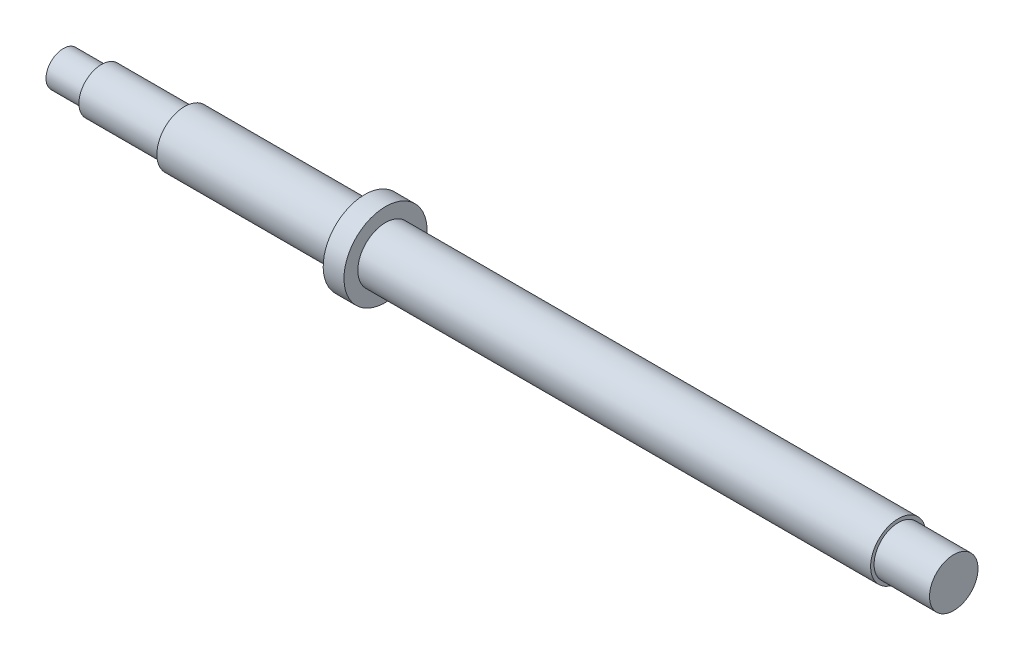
ISO-10303-21;
HEADER;
FILE_DESCRIPTION(('STEP AP214'),'2;1');
FILE_NAME('part.step','',(''),(''),'','','');
FILE_SCHEMA(('AUTOMOTIVE_DESIGN { 1 0 10303 214 1 1 1 1 }'));
ENDSEC;
DATA;
#1=APPLICATION_CONTEXT('core data for automotive mechanical design processes');
#2=APPLICATION_PROTOCOL_DEFINITION('international standard','automotive_design',2000,#1);
#3=PRODUCT_CONTEXT('',#1,'mechanical');
#4=PRODUCT('Part','Part','',(#3));
#5=PRODUCT_RELATED_PRODUCT_CATEGORY('part','',(#4));
#6=PRODUCT_DEFINITION_FORMATION('','',#4);
#7=PRODUCT_DEFINITION_CONTEXT('part definition',#1,'design');
#8=PRODUCT_DEFINITION('design','',#6,#7);
#9=PRODUCT_DEFINITION_SHAPE('','',#8);
#10=(LENGTH_UNIT() NAMED_UNIT(*) SI_UNIT(.MILLI.,.METRE.));
#11=(NAMED_UNIT(*) PLANE_ANGLE_UNIT() SI_UNIT($,.RADIAN.));
#12=(NAMED_UNIT(*) SI_UNIT($,.STERADIAN.) SOLID_ANGLE_UNIT());
#13=UNCERTAINTY_MEASURE_WITH_UNIT(LENGTH_MEASURE(1.E-05),#10,'distance_accuracy_value','');
#14=(GEOMETRIC_REPRESENTATION_CONTEXT(3) GLOBAL_UNCERTAINTY_ASSIGNED_CONTEXT((#13)) GLOBAL_UNIT_ASSIGNED_CONTEXT((#10,
#11,#12)) REPRESENTATION_CONTEXT('',''));
#15=CARTESIAN_POINT('',(0.,0.,0.));
#16=DIRECTION('',(0.,0.,1.));
#17=DIRECTION('',(1.,0.,0.));
#18=AXIS2_PLACEMENT_3D('',#15,#16,#17);
#19=CARTESIAN_POINT('',(0.,0.,0.));
#20=DIRECTION('',(-1.,0.,0.));
#21=DIRECTION('',(0.,-1.,0.));
#22=AXIS2_PLACEMENT_3D('',#19,#20,#21);
#23=PLANE('',#22);
#24=CARTESIAN_POINT('',(0.,0.,0.));
#25=DIRECTION('',(1.,0.,0.));
#26=DIRECTION('',(0.,1.,0.));
#27=AXIS2_PLACEMENT_3D('',#24,#25,#26);
#28=CIRCLE('',#27,5.);
#29=CARTESIAN_POINT('',(0.,5.,0.));
#30=VERTEX_POINT('',#29);
#31=EDGE_CURVE('E10',#30,#30,#28,.T.);
#32=ORIENTED_EDGE('',*,*,#31,.F.);
#33=EDGE_LOOP('',(#32));
#34=FACE_BOUND('',#33,.T.);
#35=ADVANCED_FACE('F34',(#34),#23,.T.);
#36=CARTESIAN_POINT('',(257.,0.,0.));
#37=DIRECTION('',(1.,0.,0.));
#38=DIRECTION('',(0.,1.,0.));
#39=AXIS2_PLACEMENT_3D('',#36,#37,#38);
#40=CYLINDRICAL_SURFACE('',#39,5.);
#41=ORIENTED_EDGE('',*,*,#31,.T.);
#42=EDGE_LOOP('',(#41));
#43=FACE_BOUND('',#42,.T.);
#44=CARTESIAN_POINT('',(11.,0.,0.));
#45=DIRECTION('',(1.,0.,0.));
#46=DIRECTION('',(0.,1.,0.));
#47=AXIS2_PLACEMENT_3D('',#44,#45,#46);
#48=CIRCLE('',#47,5.);
#49=CARTESIAN_POINT('',(11.,5.,0.));
#50=VERTEX_POINT('',#49);
#51=EDGE_CURVE('E40',#50,#50,#48,.T.);
#52=ORIENTED_EDGE('',*,*,#51,.F.);
#53=EDGE_LOOP('',(#52));
#54=FACE_BOUND('',#53,.T.);
#55=ADVANCED_FACE('F94',(#43,#54),#40,.T.);
#56=CARTESIAN_POINT('',(11.,5.,0.));
#57=DIRECTION('',(-1.,0.,0.));
#58=DIRECTION('',(0.,-1.,0.));
#59=AXIS2_PLACEMENT_3D('',#56,#57,#58);
#60=PLANE('',#59);
#61=ORIENTED_EDGE('',*,*,#51,.T.);
#62=EDGE_LOOP('',(#61));
#63=FACE_BOUND('',#62,.T.);
#64=CARTESIAN_POINT('',(11.,0.,0.));
#65=DIRECTION('',(1.,0.,0.));
#66=DIRECTION('',(0.,1.,0.));
#67=AXIS2_PLACEMENT_3D('',#64,#65,#66);
#68=CIRCLE('',#67,6.5);
#69=CARTESIAN_POINT('',(11.,6.5,0.));
#70=VERTEX_POINT('',#69);
#71=EDGE_CURVE('E44',#70,#70,#68,.T.);
#72=ORIENTED_EDGE('',*,*,#71,.F.);
#73=EDGE_LOOP('',(#72));
#74=FACE_BOUND('',#73,.T.);
#75=ADVANCED_FACE('F99',(#63,#74),#60,.T.);
#76=CARTESIAN_POINT('',(257.,0.,0.));
#77=DIRECTION('',(1.,0.,0.));
#78=DIRECTION('',(0.,1.,0.));
#79=AXIS2_PLACEMENT_3D('',#76,#77,#78);
#80=CYLINDRICAL_SURFACE('',#79,6.5);
#81=ORIENTED_EDGE('',*,*,#71,.T.);
#82=EDGE_LOOP('',(#81));
#83=FACE_BOUND('',#82,.T.);
#84=CARTESIAN_POINT('',(35.,0.,0.));
#85=DIRECTION('',(1.,0.,0.));
#86=DIRECTION('',(0.,1.,0.));
#87=AXIS2_PLACEMENT_3D('',#84,#85,#86);
#88=CIRCLE('',#87,6.5);
#89=CARTESIAN_POINT('',(35.,6.5,0.));
#90=VERTEX_POINT('',#89);
#91=EDGE_CURVE('E48',#90,#90,#88,.T.);
#92=ORIENTED_EDGE('',*,*,#91,.F.);
#93=EDGE_LOOP('',(#92));
#94=FACE_BOUND('',#93,.T.);
#95=ADVANCED_FACE('F103',(#83,#94),#80,.T.);
#96=CARTESIAN_POINT('',(35.,6.5,0.));
#97=DIRECTION('',(-1.,0.,0.));
#98=DIRECTION('',(0.,-1.,0.));
#99=AXIS2_PLACEMENT_3D('',#96,#97,#98);
#100=PLANE('',#99);
#101=ORIENTED_EDGE('',*,*,#91,.T.);
#102=EDGE_LOOP('',(#101));
#103=FACE_BOUND('',#102,.T.);
#104=CARTESIAN_POINT('',(35.,0.,0.));
#105=DIRECTION('',(1.,0.,0.));
#106=DIRECTION('',(0.,1.,0.));
#107=AXIS2_PLACEMENT_3D('',#104,#105,#106);
#108=CIRCLE('',#107,8.);
#109=CARTESIAN_POINT('',(35.,8.,0.));
#110=VERTEX_POINT('',#109);
#111=EDGE_CURVE('E53',#110,#110,#108,.T.);
#112=ORIENTED_EDGE('',*,*,#111,.F.);
#113=EDGE_LOOP('',(#112));
#114=FACE_BOUND('',#113,.T.);
#115=ADVANCED_FACE('F109',(#103,#114),#100,.T.);
#116=CARTESIAN_POINT('',(257.,0.,0.));
#117=DIRECTION('',(1.,0.,0.));
#118=DIRECTION('',(0.,1.,0.));
#119=AXIS2_PLACEMENT_3D('',#116,#117,#118);
#120=CYLINDRICAL_SURFACE('',#119,8.);
#121=ORIENTED_EDGE('',*,*,#111,.T.);
#122=EDGE_LOOP('',(#121));
#123=FACE_BOUND('',#122,.T.);
#124=CARTESIAN_POINT('',(87.,0.,0.));
#125=DIRECTION('',(1.,0.,0.));
#126=DIRECTION('',(0.,1.,0.));
#127=AXIS2_PLACEMENT_3D('',#124,#125,#126);
#128=CIRCLE('',#127,8.);
#129=CARTESIAN_POINT('',(87.,8.,0.));
#130=VERTEX_POINT('',#129);
#131=EDGE_CURVE('E56',#130,#130,#128,.T.);
#132=ORIENTED_EDGE('',*,*,#131,.F.);
#133=EDGE_LOOP('',(#132));
#134=FACE_BOUND('',#133,.T.);
#135=ADVANCED_FACE('F113',(#123,#134),#120,.T.);
#136=CARTESIAN_POINT('',(87.,8.,0.));
#137=DIRECTION('',(-1.,0.,0.));
#138=DIRECTION('',(0.,-1.,0.));
#139=AXIS2_PLACEMENT_3D('',#136,#137,#138);
#140=PLANE('',#139);
#141=ORIENTED_EDGE('',*,*,#131,.T.);
#142=EDGE_LOOP('',(#141));
#143=FACE_BOUND('',#142,.T.);
#144=CARTESIAN_POINT('',(87.,0.,0.));
#145=DIRECTION('',(1.,0.,0.));
#146=DIRECTION('',(0.,1.,0.));
#147=AXIS2_PLACEMENT_3D('',#144,#145,#146);
#148=CIRCLE('',#147,12.);
#149=CARTESIAN_POINT('',(87.,12.,0.));
#150=VERTEX_POINT('',#149);
#151=EDGE_CURVE('E59',#150,#150,#148,.T.);
#152=ORIENTED_EDGE('',*,*,#151,.F.);
#153=EDGE_LOOP('',(#152));
#154=FACE_BOUND('',#153,.T.);
#155=ADVANCED_FACE('F117',(#143,#154),#140,.T.);
#156=CARTESIAN_POINT('',(257.,0.,0.));
#157=DIRECTION('',(1.,0.,0.));
#158=DIRECTION('',(0.,1.,0.));
#159=AXIS2_PLACEMENT_3D('',#156,#157,#158);
#160=CYLINDRICAL_SURFACE('',#159,12.);
#161=ORIENTED_EDGE('',*,*,#151,.T.);
#162=EDGE_LOOP('',(#161));
#163=FACE_BOUND('',#162,.T.);
#164=CARTESIAN_POINT('',(93.,0.,0.));
#165=DIRECTION('',(1.,0.,0.));
#166=DIRECTION('',(0.,1.,0.));
#167=AXIS2_PLACEMENT_3D('',#164,#165,#166);
#168=CIRCLE('',#167,12.);
#169=CARTESIAN_POINT('',(93.,12.,0.));
#170=VERTEX_POINT('',#169);
#171=EDGE_CURVE('E62',#170,#170,#168,.T.);
#172=ORIENTED_EDGE('',*,*,#171,.F.);
#173=EDGE_LOOP('',(#172));
#174=FACE_BOUND('',#173,.T.);
#175=ADVANCED_FACE('F121',(#163,#174),#160,.T.);
#176=CARTESIAN_POINT('',(93.,12.,0.));
#177=DIRECTION('',(1.,0.,0.));
#178=DIRECTION('',(0.,1.,0.));
#179=AXIS2_PLACEMENT_3D('',#176,#177,#178);
#180=PLANE('',#179);
#181=ORIENTED_EDGE('',*,*,#171,.T.);
#182=EDGE_LOOP('',(#181));
#183=FACE_BOUND('',#182,.T.);
#184=CARTESIAN_POINT('',(93.,0.,0.));
#185=DIRECTION('',(1.,0.,0.));
#186=DIRECTION('',(0.,1.,0.));
#187=AXIS2_PLACEMENT_3D('',#184,#185,#186);
#188=CIRCLE('',#187,8.);
#189=CARTESIAN_POINT('',(93.,8.,0.));
#190=VERTEX_POINT('',#189);
#191=EDGE_CURVE('E65',#190,#190,#188,.T.);
#192=ORIENTED_EDGE('',*,*,#191,.F.);
#193=EDGE_LOOP('',(#192));
#194=FACE_BOUND('',#193,.T.);
#195=ADVANCED_FACE('F125',(#183,#194),#180,.T.);
#196=CARTESIAN_POINT('',(257.,0.,0.));
#197=DIRECTION('',(1.,0.,0.));
#198=DIRECTION('',(0.,1.,0.));
#199=AXIS2_PLACEMENT_3D('',#196,#197,#198);
#200=CYLINDRICAL_SURFACE('',#199,8.);
#201=ORIENTED_EDGE('',*,*,#191,.T.);
#202=EDGE_LOOP('',(#201));
#203=FACE_BOUND('',#202,.T.);
#204=CARTESIAN_POINT('',(241.,0.,0.));
#205=DIRECTION('',(1.,0.,0.));
#206=DIRECTION('',(0.,1.,0.));
#207=AXIS2_PLACEMENT_3D('',#204,#205,#206);
#208=CIRCLE('',#207,8.);
#209=CARTESIAN_POINT('',(241.,8.,0.));
#210=VERTEX_POINT('',#209);
#211=EDGE_CURVE('E68',#210,#210,#208,.T.);
#212=ORIENTED_EDGE('',*,*,#211,.F.);
#213=EDGE_LOOP('',(#212));
#214=FACE_BOUND('',#213,.T.);
#215=ADVANCED_FACE('F90',(#203,#214),#200,.T.);
#216=CARTESIAN_POINT('',(241.,8.,0.));
#217=DIRECTION('',(1.,0.,0.));
#218=DIRECTION('',(0.,1.,0.));
#219=AXIS2_PLACEMENT_3D('',#216,#217,#218);
#220=PLANE('',#219);
#221=ORIENTED_EDGE('',*,*,#211,.T.);
#222=EDGE_LOOP('',(#221));
#223=FACE_BOUND('',#222,.T.);
#224=CARTESIAN_POINT('',(241.,0.,0.));
#225=DIRECTION('',(1.,0.,0.));
#226=DIRECTION('',(0.,1.,0.));
#227=AXIS2_PLACEMENT_3D('',#224,#225,#226);
#228=CIRCLE('',#227,7.);
#229=CARTESIAN_POINT('',(241.,7.,0.));
#230=VERTEX_POINT('',#229);
#231=EDGE_CURVE('E71',#230,#230,#228,.T.);
#232=ORIENTED_EDGE('',*,*,#231,.F.);
#233=EDGE_LOOP('',(#232));
#234=FACE_BOUND('',#233,.T.);
#235=ADVANCED_FACE('F82',(#223,#234),#220,.T.);
#236=CARTESIAN_POINT('',(257.,0.,0.));
#237=DIRECTION('',(1.,0.,0.));
#238=DIRECTION('',(0.,1.,0.));
#239=AXIS2_PLACEMENT_3D('',#236,#237,#238);
#240=CYLINDRICAL_SURFACE('',#239,7.);
#241=ORIENTED_EDGE('',*,*,#231,.T.);
#242=EDGE_LOOP('',(#241));
#243=FACE_BOUND('',#242,.T.);
#244=CARTESIAN_POINT('',(257.,0.,0.));
#245=DIRECTION('',(1.,0.,0.));
#246=DIRECTION('',(0.,1.,0.));
#247=AXIS2_PLACEMENT_3D('',#244,#245,#246);
#248=CIRCLE('',#247,7.);
#249=CARTESIAN_POINT('',(257.,7.,0.));
#250=VERTEX_POINT('',#249);
#251=EDGE_CURVE('E74',#250,#250,#248,.T.);
#252=ORIENTED_EDGE('',*,*,#251,.F.);
#253=EDGE_LOOP('',(#252));
#254=FACE_BOUND('',#253,.T.);
#255=ADVANCED_FACE('F80',(#243,#254),#240,.T.);
#256=CARTESIAN_POINT('',(257.,7.,0.));
#257=DIRECTION('',(1.,0.,0.));
#258=DIRECTION('',(0.,1.,0.));
#259=AXIS2_PLACEMENT_3D('',#256,#257,#258);
#260=PLANE('',#259);
#261=ORIENTED_EDGE('',*,*,#251,.T.);
#262=EDGE_LOOP('',(#261));
#263=FACE_BOUND('',#262,.T.);
#264=ADVANCED_FACE('F78',(#263),#260,.T.);
#265=CLOSED_SHELL('',(#35,#55,#75,#95,#115,#135,#155,#175,#195,#215,#235,#255,#264));
#266=MANIFOLD_SOLID_BREP('B2',#265);
#267=ADVANCED_BREP_SHAPE_REPRESENTATION('',(#18,#266),#14);
#268=SHAPE_DEFINITION_REPRESENTATION(#9,#267);
ENDSEC;
END-ISO-10303-21;
